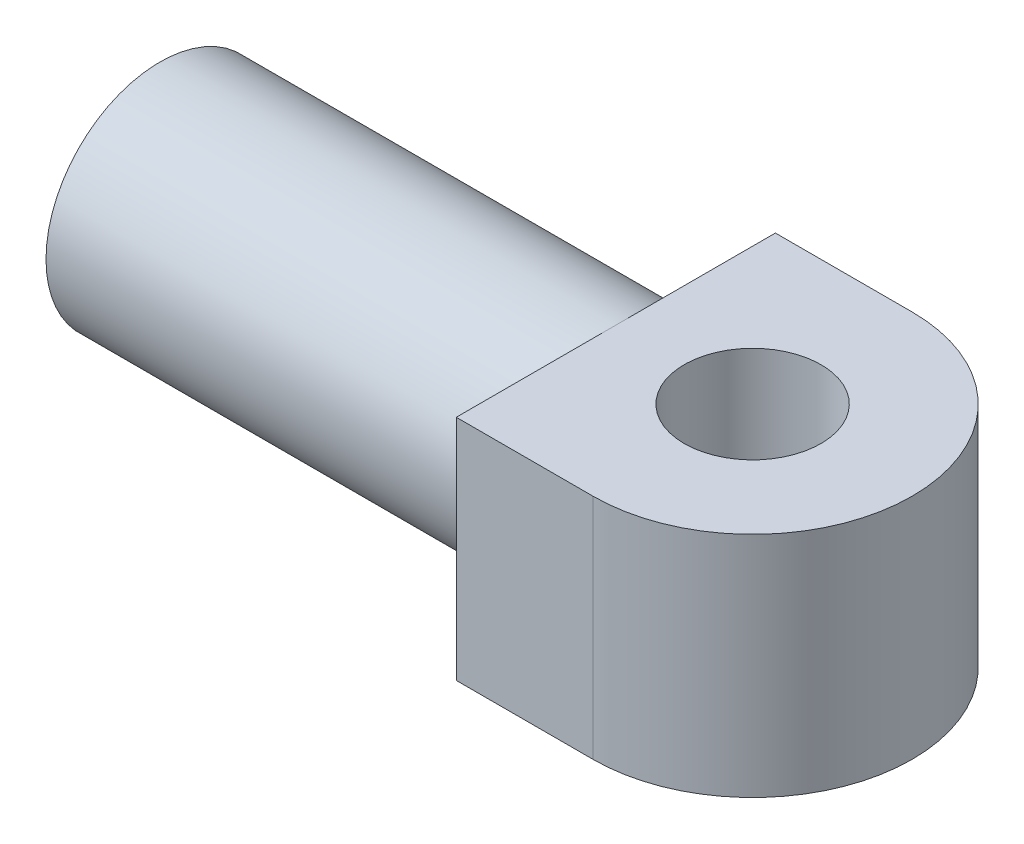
from build123d import *

# Parameters (mm, degrees)
SKETCH_6_R         = 3
EXTRUDE_3_DEPTH    = 10
SKETCH_7_R         = 5
EXTRUDE_4_DEPTH    = 20
DOME_1_FACE_RADIUS = 5
DOME_1_HEIGHT      = 1.2


with BuildPart() as part:
    # Sketch 6 → Extrude 3 (new body)
    with BuildSketch(Plane(origin=(0, 0, 0), x_dir=(1, 0, 0), z_dir=(0, 1, 0))):
        with BuildLine():
            Line((-6, 7), (-6, -7))
            Line((-6, -7), (0, -7))
            ThreePointArc((0, -7), (7, 0), (0, 7))
            Line((0, 7), (-6, 7))
        make_face()
        with Locations(Location((0, 0, 0), (0, 0, 270))):
            Circle(SKETCH_6_R, mode=Mode.SUBTRACT)
    extrude(amount=EXTRUDE_3_DEPTH)

    # Sketch 7 → Extrude 4 (add)
    with BuildSketch(Plane.ZY.offset(6)):
        with Locations(Location((0, 5, 0), (0, 0, 270))):
            Circle(SKETCH_7_R)
    extrude(amount=EXTRUDE_4_DEPTH)

    # Dome 1: a dome of height H over a round flat face of radius A is a cap of a sphere of radius (A * A + H * H) / (2 * H)
    dome_1_r = (DOME_1_FACE_RADIUS * DOME_1_FACE_RADIUS + DOME_1_HEIGHT * DOME_1_HEIGHT) / (2 * DOME_1_HEIGHT)
    dome_1_base = Plane((-26, 5, 0), z_dir=(-1, 0, 0))
    with Locations(dome_1_base.offset(DOME_1_HEIGHT - dome_1_r)):
        dome_1_ball = Sphere(dome_1_r, mode=Mode.PRIVATE)
    add(split(dome_1_ball, bisect_by=dome_1_base, keep=Keep.TOP, mode=Mode.PRIVATE))


solid = part.part
